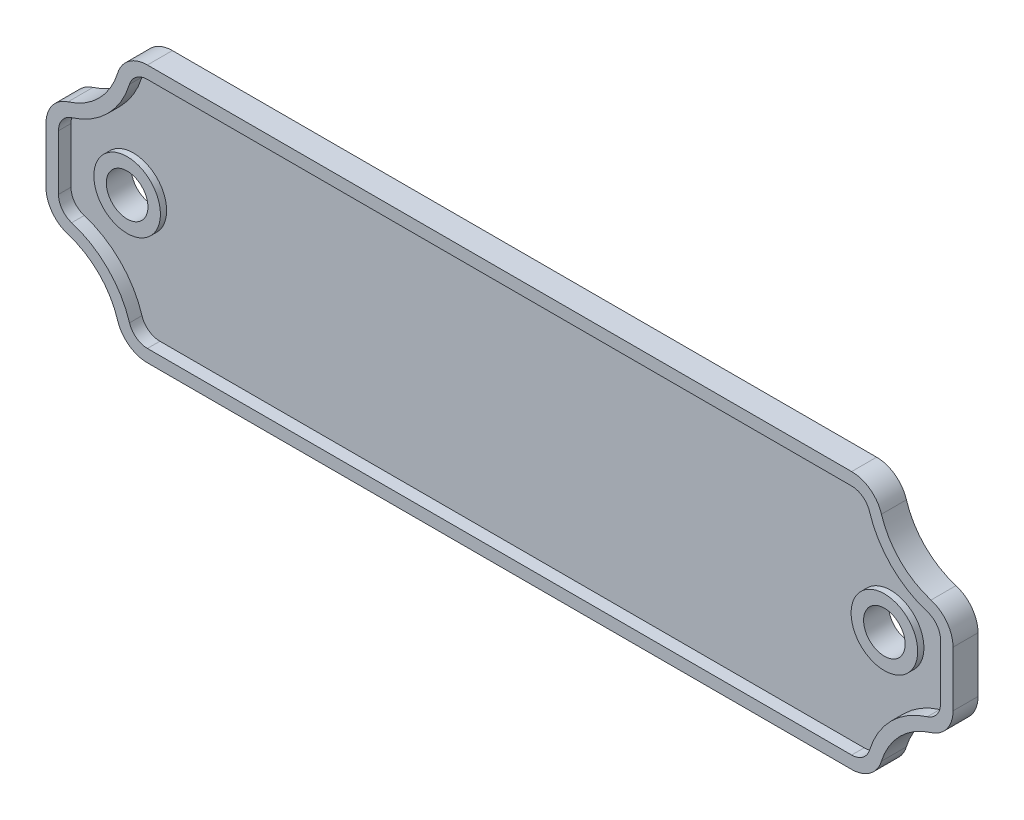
from build123d import *

# Parameters (mm, degrees)
SKETCH1_R           = 2.5
BOSS_EXTRUDE1_DEPTH = 0.75
BOSS_EXTRUDE2_START = 1.5
BOSS_EXTRUDE2_DEPTH = 1.5
SKETCH5_R           = 4
SKETCH5_R_2         = 2.5
BOSS_EXTRUDE3_DEPTH = 1.5


with BuildPart() as part:
    # Sketch1 → Boss-Extrude1 (new, symmetric)
    with BuildSketch(Plane.XY):
        with BuildLine():
            Line((-54.362440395, 3.313942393), (-54.362440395, -3.313942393))
            ThreePointArc((-54.362440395, -3.313942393), (-53.628939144, -5.541774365), (-51.715381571, -6.898076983))
            ThreePointArc((-51.715381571, -6.898076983), (-47.998479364, -9.136038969), (-45.760517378, -12.852941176))
            ThreePointArc((-45.760517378, -12.852941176), (-44.404214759, -14.76649875), (-42.176382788, -15.5))
            Line((-42.176382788, -15.5), (42.451501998, -15.5))
            ThreePointArc((42.451501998, -15.5), (44.67933397, -14.76649875), (46.035636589, -12.852941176))
            ThreePointArc((46.035636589, -12.852941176), (48.273598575, -9.136038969), (51.990500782, -6.898076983))
            ThreePointArc((51.990500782, -6.898076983), (53.904058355, -5.541774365), (54.637559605, -3.313942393))
            Line((54.637559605, -3.313942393), (54.637559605, 3.313942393))
            ThreePointArc((54.637559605, 3.313942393), (53.904058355, 5.541774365), (51.990500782, 6.898076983))
            ThreePointArc((51.990500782, 6.898076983), (48.273598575, 9.136038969), (46.035636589, 12.852941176))
            ThreePointArc((46.035636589, 12.852941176), (44.67933397, 14.76649875), (42.451501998, 15.5))
            Line((42.451501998, 15.5), (-42.176382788, 15.5))
            ThreePointArc((-42.176382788, 15.5), (-44.404214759, 14.76649875), (-45.760517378, 12.852941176))
            ThreePointArc((-45.760517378, 12.852941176), (-47.998479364, 9.136038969), (-51.715381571, 6.898076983))
            ThreePointArc((-51.715381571, 6.898076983), (-53.628939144, 5.541774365), (-54.362440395, 3.313942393))
        make_face()
        with Locations((-45.362440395, 0)):
            Circle(SKETCH1_R, mode=Mode.SUBTRACT)
        with Locations((45.637559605, 0)):
            Circle(SKETCH1_R, mode=Mode.SUBTRACT)
    extrude(amount=BOSS_EXTRUDE1_DEPTH, both=True)

    # Sketch3 → Boss-Extrude2 (add)
    with BuildSketch(Plane.XY.offset(0.75).offset(BOSS_EXTRUDE2_START)):
        with BuildLine():
            Line((54.637559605, -3.313942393), (54.637559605, 3.313942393))
            ThreePointArc((54.637559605, 3.313942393), (53.904058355, 5.541774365), (51.990500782, 6.898076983))
            ThreePointArc((51.990500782, 6.898076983), (48.273598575, 9.136038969), (46.035636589, 12.852941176))
            ThreePointArc((46.035636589, 12.852941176), (44.67933397, 14.76649875), (42.451501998, 15.5))
            Line((42.451501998, 15.5), (-42.176382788, 15.5))
            ThreePointArc((-42.176382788, 15.5), (-44.404214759, 14.76649875), (-45.760517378, 12.852941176))
            ThreePointArc((-45.760517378, 12.852941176), (-47.998479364, 9.136038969), (-51.715381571, 6.898076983))
            ThreePointArc((-51.715381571, 6.898076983), (-53.628939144, 5.541774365), (-54.362440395, 3.313942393))
            Line((-54.362440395, 3.313942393), (-54.362440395, -3.313942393))
            ThreePointArc((-54.362440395, -3.313942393), (-53.628939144, -5.541774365), (-51.715381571, -6.898076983))
            ThreePointArc((-51.715381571, -6.898076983), (-47.998479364, -9.136038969), (-45.760517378, -12.852941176))
            ThreePointArc((-45.760517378, -12.852941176), (-44.404214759, -14.76649875), (-42.176382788, -15.5))
            Line((-42.176382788, -15.5), (42.451501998, -15.5))
            ThreePointArc((42.451501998, -15.5), (44.67933397, -14.76649875), (46.035636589, -12.852941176))
            ThreePointArc((46.035636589, -12.852941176), (48.273598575, -9.136038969), (51.990500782, -6.898076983))
            ThreePointArc((51.990500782, -6.898076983), (53.904058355, -5.541774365), (54.637559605, -3.313942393))
        make_face()
        with BuildLine():
            Line((53.137559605, -3.313942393), (53.137559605, 3.313942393))
            ThreePointArc((53.137559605, 3.313942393), (52.697458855, 4.650641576), (51.549324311, 5.464423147))
            ThreePointArc((51.549324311, 5.464423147), (47.212938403, 8.075378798), (44.601982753, 12.411764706))
            ThreePointArc((44.601982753, 12.411764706), (43.788201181, 13.55989925), (42.451501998, 14))
            Line((42.451501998, 14), (-42.176382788, 14))
            ThreePointArc((-42.176382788, 14), (-43.513081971, 13.55989925), (-44.326863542, 12.411764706))
            ThreePointArc((-44.326863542, 12.411764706), (-46.937819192, 8.075378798), (-51.274205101, 5.464423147))
            ThreePointArc((-51.274205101, 5.464423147), (-52.422339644, 4.650641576), (-52.862440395, 3.313942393))
            Line((-52.862440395, 3.313942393), (-52.862440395, -3.313942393))
            ThreePointArc((-52.862440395, -3.313942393), (-52.422339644, -4.650641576), (-51.274205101, -5.464423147))
            ThreePointArc((-51.274205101, -5.464423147), (-46.937819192, -8.075378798), (-44.326863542, -12.411764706))
            ThreePointArc((-44.326863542, -12.411764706), (-43.513081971, -13.55989925), (-42.176382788, -14))
            Line((-42.176382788, -14), (42.451501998, -14))
            ThreePointArc((42.451501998, -14), (43.788201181, -13.55989925), (44.601982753, -12.411764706))
            ThreePointArc((44.601982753, -12.411764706), (47.212938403, -8.075378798), (51.549324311, -5.464423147))
            ThreePointArc((51.549324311, -5.464423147), (52.697458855, -4.650641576), (53.137559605, -3.313942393))
        make_face(mode=Mode.SUBTRACT)
    extrude(amount=-BOSS_EXTRUDE2_DEPTH)

    # Sketch5 → Boss-Extrude3 (add, symmetric)
    # profile 1 of 2: a face of its own
    with BuildSketch(Plane.XY):
        with Locations(Location((-45.362440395, 0, 0), (0, 0, 180))):
            Circle(SKETCH5_R)
        with Locations((-45.362440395, 0)):
            Circle(SKETCH5_R_2, mode=Mode.SUBTRACT)
    # profile 2 of 2: a face of its own
    with BuildSketch(Plane.XY):
        with Locations(Location((45.637559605, 0, 0), (0, 0, 180))):
            Circle(SKETCH5_R)
        with Locations((45.637559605, 0)):
            Circle(SKETCH5_R_2, mode=Mode.SUBTRACT)
    extrude(amount=BOSS_EXTRUDE3_DEPTH, both=True)


solid = part.part
